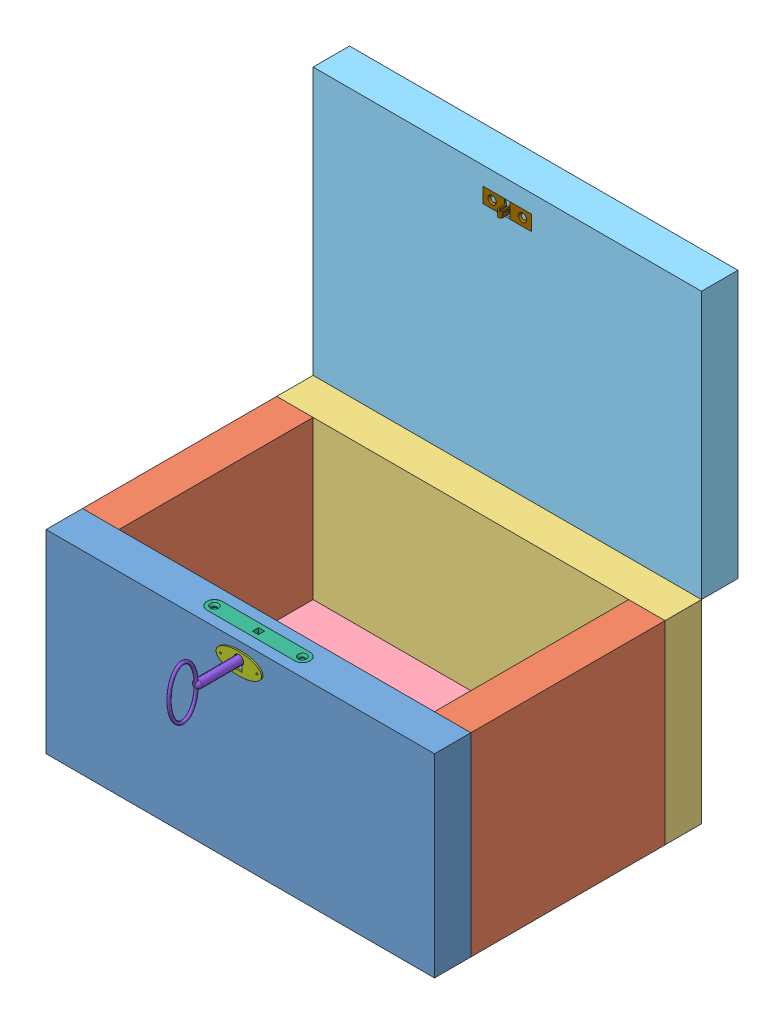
SolidWorks assembly Box Assembly.SLDASM, configuration Default (file format 11000). Lengths in mm.
Overall size (203.2 241.3 196.85).
10 component instances, 9 part files, 26 mates.
Components (placement in the parent):
- 0.75x18x6-3: 0.75x18x6.SLDPRT [Default] at origin size (203.2 101.6 19.05)
- 0.75x24x6-1: 0.75x24x6.SLDPRT [Default] at (19.05 0 -19.05) x (0 0 -1) z (1 0 0) size (101.6 101.6 19.05)
- 0.75x24x6-2: 0.75x24x6.SLDPRT [Default] at (203.2 0 -19.05) x (0 0 -1) z (1 0 0) size (101.6 101.6 19.05)
- Rear Panel-2: Rear Panel.SLDPRT [Default] at (0 0 -120.65) size (203.2 101.6 19.05)
- Bottom-1: Bottom.SLDPRT [Default] at (19.05 -101.6 -120.65) size (165.1 19.05 101.6)
- Cover-1: Cover.SLDPRT [Default] at (0 0 -139.7) x (1 0 0) z (0 1 0) size (203.2 19.05 139.7)
- Lock-1: Lock.SLDPRT [Default] at (101.6 0 -9.525) size (53.98 17.46 7.94)
- Key Plate-1: Key Plate.SLDPRT [Default] at (101.6 -9.525 0.7937) size (23.81 11.11 0.79)
- Key-1: Key.SLDPRT [Default] at (101.6 -7.9375 -11.1125) size (4.29 28.57 49.21)
- Latch-1: Latch.SLDPRT [Default] at (101.6 126.2062 -139.7) x (1 0 0) z (0 -1 0) size (25.4 5.56 7.94)
Mates (geometry in assembly coordinates):
- Coincident1: coincident: plane of 0.75x18x6-3 through (0 0 -19.05) normal (0 1 0); plane of 0.75x24x6-1 through (0 0 -19.05) normal (0 1 0)
- Coincident2: coincident: plane of 0.75x24x6-1 through (19.05 -101.6 -19.05) normal (0 0 1); plane of 0.75x18x6-3 through (0 -101.6 -19.05) normal (0 0 -1)
- Coincident3: coincident: plane of 0.75x18x6-3 through (0 -101.6 0) normal (-1 0 0); plane of 0.75x24x6-1 through (0 -101.6 -19.05) normal (-1 0 0)
- Coincident4: coincident: plane of 0.75x18x6-3 through (0 0 -19.05) normal (0 1 0); plane of 0.75x24x6-2 through (184.15 0 -19.05) normal (0 1 0)
- Coincident5: coincident: plane of 0.75x18x6-3 through (203.2 -101.6 0) normal (1 0 0); plane of 0.75x24x6-2 through (203.2 -101.6 -19.05) normal (1 0 0)
- Coincident6: coincident: plane of 0.75x18x6-3 through (0 -101.6 -19.05) normal (0 0 -1); plane of 0.75x24x6-2 through (203.2 -101.6 -19.05) normal (0 0 1)
- Coincident10: coincident: plane of 0.75x24x6-1 through (19.05 -101.6 -120.65) normal (0 0 -1); plane of Rear Panel-2 through (0 -101.6 -120.65) normal (0 0 1)
- Coincident11: coincident: plane of 0.75x24x6-1 through (0 0 -19.05) normal (0 1 0); plane of Rear Panel-2 through (0 0 -139.7) normal (0 1 0)
- Coincident12: coincident: plane of 0.75x24x6-1 through (0 -101.6 -19.05) normal (-1 0 0); plane of Rear Panel-2 through (0 -101.6 -120.65) normal (-1 0 0)
- Coincident16: coincident: plane of 0.75x24x6-1 through (19.05 -101.6 -19.05) normal (1 0 0); plane of Bottom-1 through (19.05 -82.55 -19.05) normal (-1 0 0)
- Coincident17: coincident: plane of 0.75x18x6-3 through (0 -101.6 -19.05) normal (0 0 -1); plane of Bottom-1 through (184.15 -101.6 -19.05) normal (0 0 1)
- Coincident18: coincident: plane of Bottom-1 through (184.15 -101.6 -19.05) normal (0 -1 0); plane of Rear Panel-2 through (0 -101.6 -139.7) normal (0 -1 0)
- Coincident19: coincident: plane of 0.75x24x6-2 through (203.2 -101.6 -19.05) normal (1 0 0); plane of Cover-1 through (203.2 139.7 -139.7) normal (1 0 0)
- Coincident20: coincident: line of Rear Panel-2 through (203.2 0 -139.7) axis (-1 0 0); line of Cover-1 through (0 0 -139.7) axis (1 0 0)
- Angle1: planar angle = 1.570796 rad: plane of 0.75x24x6-2 through (184.15 0 -19.05) normal (0 1 0); plane of Cover-1 through (0 139.7 -139.7) normal (0 0 1)
- Width1: width: plane of Lock-1 through (115.8875 -17.4625 -7.1437) normal (1 0 0); plane of Lock-1 through (87.3125 -17.4625 -7.1437) normal (-1 0 0); plane of 0.75x18x6-3 through (0 -101.6 0) normal (-1 0 0); plane of 0.75x18x6-3 through (203.2 -101.6 0) normal (1 0 0)
- Width2: width: plane of Lock-1 through (87.3125 -17.4625 -7.1437) normal (0 0 1); plane of Lock-1 through (87.3125 -17.4625 -11.9062) normal (0 0 -1); plane of 0.75x18x6-3 through (0 -101.6 -19.05) normal (0 0 -1); plane of 0.75x18x6-3 through (0 -101.6 0) normal (0 0 1)
- Coincident22: coincident: plane of 0.75x18x6-3 through (0 0 -19.05) normal (0 1 0); plane of Lock-1 through (78.5813 0 -9.525) normal (0 1 0)
- Coincident23: coincident: plane of 0.75x18x6-3 through (0 -101.6 0) normal (0 0 1); plane of Key Plate-1 through (101.6 -9.525 0) normal (0 0 -1)
- Concentric1: concentric: cylinder of 0.75x18x6-3 through (101.6 -7.9375 -500000) axis (0 0 1) radius 2.54; cylinder of Key Plate-1 through (101.6 -7.9375 0) axis (0 0 1) radius 2.54
- Coincident24: coincident: plane of 0.75x18x6-3 through (100.0125 -9.9203 -500000) normal (1 0 0); plane of Key Plate-1 through (100.0125 -9.9203 0) normal (1 0 0)
- Concentric2: concentric: cylinder of Key Plate-1 through (101.6 -7.9375 0) axis (0 0 1) radius 2.54; cylinder of Key-1 through (101.6 -7.9375 -7.9375) axis (0 0 -1) radius 2.1431
- Coincident25: coincident: plane of Lock-1 through (100.0125 -6.35 -11.1125) normal (0 0 1); plane of Key-1 through (101.6 -7.9375 -11.1125) normal (0 0 -1)
- Coincident26: coincident: plane of Cover-1 through (0 139.7 -139.7) normal (0 0 1); plane of Latch-1 through (114.3 122.2375 -139.7) normal (0 0 1)
- Distance1: distance = 9.525 mm: plane of Cover-1 through (0 139.7 -158.75) normal (0 1 0); plane of Latch-1 through (103.124 130.175 -139.446) normal (0 1 0)
- Width3: width: plane of Cover-1 through (0 139.7 -139.7) normal (-1 0 0); plane of Cover-1 through (203.2 139.7 -139.7) normal (1 0 0); plane of Latch-1 through (88.9 122.2375 -140.4938) normal (-1 0 0); plane of Latch-1 through (114.3 122.2375 -139.7) normal (1 0 0)
